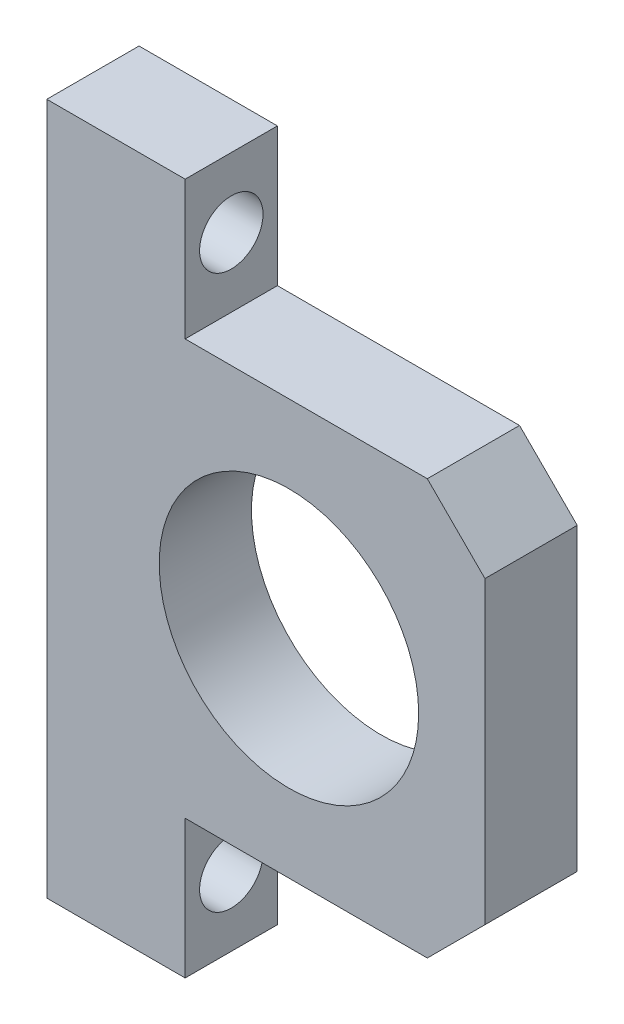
ISO-10303-21;
HEADER;
FILE_DESCRIPTION(('STEP AP214'),'2;1');
FILE_NAME('part.step','',(''),(''),'','','');
FILE_SCHEMA(('AUTOMOTIVE_DESIGN { 1 0 10303 214 1 1 1 1 }'));
ENDSEC;
DATA;
#1=APPLICATION_CONTEXT('core data for automotive mechanical design processes');
#2=APPLICATION_PROTOCOL_DEFINITION('international standard','automotive_design',2000,#1);
#3=PRODUCT_CONTEXT('',#1,'mechanical');
#4=PRODUCT('Part','Part','',(#3));
#5=PRODUCT_RELATED_PRODUCT_CATEGORY('part','',(#4));
#6=PRODUCT_DEFINITION_FORMATION('','',#4);
#7=PRODUCT_DEFINITION_CONTEXT('part definition',#1,'design');
#8=PRODUCT_DEFINITION('design','',#6,#7);
#9=PRODUCT_DEFINITION_SHAPE('','',#8);
#10=(LENGTH_UNIT() NAMED_UNIT(*) SI_UNIT(.MILLI.,.METRE.));
#11=(NAMED_UNIT(*) PLANE_ANGLE_UNIT() SI_UNIT($,.RADIAN.));
#12=(NAMED_UNIT(*) SI_UNIT($,.STERADIAN.) SOLID_ANGLE_UNIT());
#13=UNCERTAINTY_MEASURE_WITH_UNIT(LENGTH_MEASURE(1.E-05),#10,'distance_accuracy_value','');
#14=(GEOMETRIC_REPRESENTATION_CONTEXT(3) GLOBAL_UNCERTAINTY_ASSIGNED_CONTEXT((#13)) GLOBAL_UNIT_ASSIGNED_CONTEXT((#10,
#11,#12)) REPRESENTATION_CONTEXT('',''));
#15=CARTESIAN_POINT('',(0.,0.,0.));
#16=DIRECTION('',(0.,0.,1.));
#17=DIRECTION('',(1.,0.,0.));
#18=AXIS2_PLACEMENT_3D('',#15,#16,#17);
#19=CARTESIAN_POINT('',(171.801480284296,117.437114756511,8.));
#20=DIRECTION('',(1.,0.,0.));
#21=DIRECTION('',(0.,0.,-1.));
#22=AXIS2_PLACEMENT_3D('',#19,#20,#21);
#23=PLANE('',#22);
#24=CARTESIAN_POINT('',(171.801480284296,111.437114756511,4.));
#25=DIRECTION('',(1.,0.,0.));
#26=DIRECTION('',(0.,0.,-1.));
#27=AXIS2_PLACEMENT_3D('',#24,#25,#26);
#28=CIRCLE('',#27,2.75);
#29=CARTESIAN_POINT('',(171.801480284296,111.437114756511,1.25));
#30=VERTEX_POINT('',#29);
#31=EDGE_CURVE('E253',#30,#30,#28,.T.);
#32=ORIENTED_EDGE('',*,*,#31,.T.);
#33=EDGE_LOOP('',(#32));
#34=FACE_BOUND('',#33,.T.);
#35=CARTESIAN_POINT('',(171.801480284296,63.4371147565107,4.));
#36=DIRECTION('',(1.,0.,0.));
#37=DIRECTION('',(0.,0.,-1.));
#38=AXIS2_PLACEMENT_3D('',#35,#36,#37);
#39=CIRCLE('',#38,2.75);
#40=CARTESIAN_POINT('',(171.801480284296,63.4371147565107,1.25));
#41=VERTEX_POINT('',#40);
#42=EDGE_CURVE('E263',#41,#41,#39,.T.);
#43=ORIENTED_EDGE('',*,*,#42,.T.);
#44=EDGE_LOOP('',(#43));
#45=FACE_BOUND('',#44,.T.);
#46=DIRECTION('',(0.,-1.,0.));
#47=VECTOR('',#46,1.);
#48=CARTESIAN_POINT('',(171.801480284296,117.437114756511,0.));
#49=LINE('',#48,#47);
#50=CARTESIAN_POINT('',(171.801480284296,117.437114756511,0.));
#51=VERTEX_POINT('',#50);
#52=CARTESIAN_POINT('',(171.801480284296,57.4371147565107,0.));
#53=VERTEX_POINT('',#52);
#54=EDGE_CURVE('E118',#51,#53,#49,.T.);
#55=ORIENTED_EDGE('',*,*,#54,.T.);
#56=DIRECTION('',(0.,0.,-1.));
#57=VECTOR('',#56,1.);
#58=CARTESIAN_POINT('',(171.801480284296,57.4371147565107,8.));
#59=LINE('',#58,#57);
#60=CARTESIAN_POINT('',(171.801480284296,57.4371147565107,8.));
#61=VERTEX_POINT('',#60);
#62=EDGE_CURVE('E100',#61,#53,#59,.T.);
#63=ORIENTED_EDGE('',*,*,#62,.F.);
#64=DIRECTION('',(0.,-1.,0.));
#65=VECTOR('',#64,1.);
#66=CARTESIAN_POINT('',(171.801480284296,117.437114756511,8.));
#67=LINE('',#66,#65);
#68=CARTESIAN_POINT('',(171.801480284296,117.437114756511,8.));
#69=VERTEX_POINT('',#68);
#70=EDGE_CURVE('E106',#69,#61,#67,.T.);
#71=ORIENTED_EDGE('',*,*,#70,.F.);
#72=DIRECTION('',(0.,0.,-1.));
#73=VECTOR('',#72,1.);
#74=CARTESIAN_POINT('',(171.801480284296,117.437114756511,8.));
#75=LINE('',#74,#73);
#76=EDGE_CURVE('E169',#69,#51,#75,.T.);
#77=ORIENTED_EDGE('',*,*,#76,.T.);
#78=EDGE_LOOP('',(#55,#63,#71,#77));
#79=FACE_BOUND('',#78,.T.);
#80=ADVANCED_FACE('F16',(#34,#45,#79),#23,.F.);
#81=CARTESIAN_POINT('',(171.801480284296,57.4371147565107,8.));
#82=DIRECTION('',(0.,1.,0.));
#83=DIRECTION('',(0.,0.,1.));
#84=AXIS2_PLACEMENT_3D('',#81,#82,#83);
#85=PLANE('',#84);
#86=DIRECTION('',(1.,0.,0.));
#87=VECTOR('',#86,1.);
#88=CARTESIAN_POINT('',(171.801480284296,57.4371147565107,0.));
#89=LINE('',#88,#87);
#90=CARTESIAN_POINT('',(183.801480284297,57.4371147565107,0.));
#91=VERTEX_POINT('',#90);
#92=EDGE_CURVE('E161',#53,#91,#89,.T.);
#93=ORIENTED_EDGE('',*,*,#92,.T.);
#94=DIRECTION('',(0.,0.,-1.));
#95=VECTOR('',#94,1.);
#96=CARTESIAN_POINT('',(183.801480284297,57.4371147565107,8.));
#97=LINE('',#96,#95);
#98=CARTESIAN_POINT('',(183.801480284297,57.4371147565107,8.));
#99=VERTEX_POINT('',#98);
#100=EDGE_CURVE('E103',#99,#91,#97,.T.);
#101=ORIENTED_EDGE('',*,*,#100,.F.);
#102=DIRECTION('',(1.,0.,0.));
#103=VECTOR('',#102,1.);
#104=CARTESIAN_POINT('',(171.801480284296,57.4371147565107,8.));
#105=LINE('',#104,#103);
#106=EDGE_CURVE('E96',#61,#99,#105,.T.);
#107=ORIENTED_EDGE('',*,*,#106,.F.);
#108=ORIENTED_EDGE('',*,*,#62,.T.);
#109=EDGE_LOOP('',(#93,#101,#107,#108));
#110=FACE_BOUND('',#109,.T.);
#111=ADVANCED_FACE('F98',(#110),#85,.F.);
#112=CARTESIAN_POINT('',(183.801480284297,69.4371147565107,8.));
#113=DIRECTION('',(-1.,0.,0.));
#114=DIRECTION('',(0.,0.,1.));
#115=AXIS2_PLACEMENT_3D('',#112,#113,#114);
#116=PLANE('',#115);
#117=CARTESIAN_POINT('',(183.801480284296,63.4371147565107,4.));
#118=DIRECTION('',(1.,0.,0.));
#119=DIRECTION('',(0.,0.,-1.));
#120=AXIS2_PLACEMENT_3D('',#117,#118,#119);
#121=CIRCLE('',#120,2.75);
#122=CARTESIAN_POINT('',(183.801480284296,63.4371147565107,1.25));
#123=VERTEX_POINT('',#122);
#124=EDGE_CURVE('E258',#123,#123,#121,.T.);
#125=ORIENTED_EDGE('',*,*,#124,.F.);
#126=EDGE_LOOP('',(#125));
#127=FACE_BOUND('',#126,.T.);
#128=DIRECTION('',(0.,1.,0.));
#129=VECTOR('',#128,1.);
#130=CARTESIAN_POINT('',(183.801480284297,69.4371147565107,0.));
#131=LINE('',#130,#129);
#132=CARTESIAN_POINT('',(183.801480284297,69.4371147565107,0.));
#133=VERTEX_POINT('',#132);
#134=EDGE_CURVE('E157',#91,#133,#131,.T.);
#135=ORIENTED_EDGE('',*,*,#134,.T.);
#136=DIRECTION('',(0.,0.,-1.));
#137=VECTOR('',#136,1.);
#138=CARTESIAN_POINT('',(183.801480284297,69.4371147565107,8.));
#139=LINE('',#138,#137);
#140=CARTESIAN_POINT('',(183.801480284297,69.4371147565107,8.));
#141=VERTEX_POINT('',#140);
#142=EDGE_CURVE('E123',#141,#133,#139,.T.);
#143=ORIENTED_EDGE('',*,*,#142,.F.);
#144=DIRECTION('',(0.,1.,0.));
#145=VECTOR('',#144,1.);
#146=CARTESIAN_POINT('',(183.801480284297,69.4371147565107,8.));
#147=LINE('',#146,#145);
#148=EDGE_CURVE('E105',#99,#141,#147,.T.);
#149=ORIENTED_EDGE('',*,*,#148,.F.);
#150=ORIENTED_EDGE('',*,*,#100,.T.);
#151=EDGE_LOOP('',(#135,#143,#149,#150));
#152=FACE_BOUND('',#151,.T.);
#153=ADVANCED_FACE('F194',(#127,#152),#116,.F.);
#154=CARTESIAN_POINT('',(183.801480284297,69.4371147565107,8.));
#155=DIRECTION('',(0.,1.,0.));
#156=DIRECTION('',(0.,0.,1.));
#157=AXIS2_PLACEMENT_3D('',#154,#155,#156);
#158=PLANE('',#157);
#159=DIRECTION('',(1.,0.,0.));
#160=VECTOR('',#159,1.);
#161=CARTESIAN_POINT('',(183.801480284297,69.4371147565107,0.));
#162=LINE('',#161,#160);
#163=CARTESIAN_POINT('',(204.801480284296,69.4371147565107,0.));
#164=VERTEX_POINT('',#163);
#165=EDGE_CURVE('E152',#133,#164,#162,.T.);
#166=ORIENTED_EDGE('',*,*,#165,.T.);
#167=DIRECTION('',(0.,0.,1.));
#168=VECTOR('',#167,1.);
#169=CARTESIAN_POINT('',(204.801480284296,69.4371147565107,8.));
#170=LINE('',#169,#168);
#171=CARTESIAN_POINT('',(204.801480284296,69.4371147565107,8.));
#172=VERTEX_POINT('',#171);
#173=EDGE_CURVE('E39',#164,#172,#170,.T.);
#174=ORIENTED_EDGE('',*,*,#173,.T.);
#175=DIRECTION('',(1.,0.,0.));
#176=VECTOR('',#175,1.);
#177=CARTESIAN_POINT('',(183.801480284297,69.4371147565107,8.));
#178=LINE('',#177,#176);
#179=EDGE_CURVE('E137',#141,#172,#178,.T.);
#180=ORIENTED_EDGE('',*,*,#179,.F.);
#181=ORIENTED_EDGE('',*,*,#142,.T.);
#182=EDGE_LOOP('',(#166,#174,#180,#181));
#183=FACE_BOUND('',#182,.T.);
#184=ADVANCED_FACE('F155',(#183),#158,.F.);
#185=CARTESIAN_POINT('',(209.801480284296,105.437114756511,8.));
#186=DIRECTION('',(-1.,0.,0.));
#187=DIRECTION('',(0.,0.,1.));
#188=AXIS2_PLACEMENT_3D('',#185,#186,#187);
#189=PLANE('',#188);
#190=DIRECTION('',(0.,1.,0.));
#191=VECTOR('',#190,1.);
#192=CARTESIAN_POINT('',(209.801480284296,105.437114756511,8.));
#193=LINE('',#192,#191);
#194=CARTESIAN_POINT('',(209.801480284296,74.4371147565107,8.));
#195=VERTEX_POINT('',#194);
#196=CARTESIAN_POINT('',(209.801480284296,100.437114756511,8.));
#197=VERTEX_POINT('',#196);
#198=EDGE_CURVE('E136',#195,#197,#193,.T.);
#199=ORIENTED_EDGE('',*,*,#198,.F.);
#200=DIRECTION('',(0.,0.,-1.));
#201=VECTOR('',#200,1.);
#202=CARTESIAN_POINT('',(209.801480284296,74.4371147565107,8.));
#203=LINE('',#202,#201);
#204=CARTESIAN_POINT('',(209.801480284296,74.4371147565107,0.));
#205=VERTEX_POINT('',#204);
#206=EDGE_CURVE('E121',#195,#205,#203,.T.);
#207=ORIENTED_EDGE('',*,*,#206,.T.);
#208=DIRECTION('',(0.,1.,0.));
#209=VECTOR('',#208,1.);
#210=CARTESIAN_POINT('',(209.801480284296,105.437114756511,0.));
#211=LINE('',#210,#209);
#212=CARTESIAN_POINT('',(209.801480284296,100.437114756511,0.));
#213=VERTEX_POINT('',#212);
#214=EDGE_CURVE('E153',#205,#213,#211,.T.);
#215=ORIENTED_EDGE('',*,*,#214,.T.);
#216=DIRECTION('',(0.,0.,1.));
#217=VECTOR('',#216,1.);
#218=CARTESIAN_POINT('',(209.801480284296,100.437114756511,8.));
#219=LINE('',#218,#217);
#220=EDGE_CURVE('E119',#213,#197,#219,.T.);
#221=ORIENTED_EDGE('',*,*,#220,.T.);
#222=EDGE_LOOP('',(#199,#207,#215,#221));
#223=FACE_BOUND('',#222,.T.);
#224=ADVANCED_FACE('F141',(#223),#189,.F.);
#225=CARTESIAN_POINT('',(183.801480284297,105.437114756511,8.));
#226=DIRECTION('',(0.,-1.,0.));
#227=DIRECTION('',(0.,0.,-1.));
#228=AXIS2_PLACEMENT_3D('',#225,#226,#227);
#229=PLANE('',#228);
#230=DIRECTION('',(-1.,0.,0.));
#231=VECTOR('',#230,1.);
#232=CARTESIAN_POINT('',(183.801480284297,105.437114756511,8.));
#233=LINE('',#232,#231);
#234=CARTESIAN_POINT('',(204.801480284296,105.437114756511,8.));
#235=VERTEX_POINT('',#234);
#236=CARTESIAN_POINT('',(183.801480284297,105.437114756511,8.));
#237=VERTEX_POINT('',#236);
#238=EDGE_CURVE('E145',#235,#237,#233,.T.);
#239=ORIENTED_EDGE('',*,*,#238,.F.);
#240=DIRECTION('',(0.,0.,-1.));
#241=VECTOR('',#240,1.);
#242=CARTESIAN_POINT('',(204.801480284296,105.437114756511,8.));
#243=LINE('',#242,#241);
#244=CARTESIAN_POINT('',(204.801480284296,105.437114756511,0.));
#245=VERTEX_POINT('',#244);
#246=EDGE_CURVE('E11',#235,#245,#243,.T.);
#247=ORIENTED_EDGE('',*,*,#246,.T.);
#248=DIRECTION('',(-1.,0.,0.));
#249=VECTOR('',#248,1.);
#250=CARTESIAN_POINT('',(183.801480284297,105.437114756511,0.));
#251=LINE('',#250,#249);
#252=CARTESIAN_POINT('',(183.801480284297,105.437114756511,0.));
#253=VERTEX_POINT('',#252);
#254=EDGE_CURVE('E159',#245,#253,#251,.T.);
#255=ORIENTED_EDGE('',*,*,#254,.T.);
#256=DIRECTION('',(0.,0.,-1.));
#257=VECTOR('',#256,1.);
#258=CARTESIAN_POINT('',(183.801480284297,105.437114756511,8.));
#259=LINE('',#258,#257);
#260=EDGE_CURVE('E174',#237,#253,#259,.T.);
#261=ORIENTED_EDGE('',*,*,#260,.F.);
#262=EDGE_LOOP('',(#239,#247,#255,#261));
#263=FACE_BOUND('',#262,.T.);
#264=ADVANCED_FACE('F198',(#263),#229,.F.);
#265=CARTESIAN_POINT('',(183.801480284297,117.437114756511,8.));
#266=DIRECTION('',(-1.,0.,0.));
#267=DIRECTION('',(0.,-1.,0.));
#268=AXIS2_PLACEMENT_3D('',#265,#266,#267);
#269=PLANE('',#268);
#270=CARTESIAN_POINT('',(183.801480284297,111.437114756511,4.));
#271=DIRECTION('',(1.,0.,0.));
#272=DIRECTION('',(0.,0.,-1.));
#273=AXIS2_PLACEMENT_3D('',#270,#271,#272);
#274=CIRCLE('',#273,2.75);
#275=CARTESIAN_POINT('',(183.801480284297,111.437114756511,1.25));
#276=VERTEX_POINT('',#275);
#277=EDGE_CURVE('E256',#276,#276,#274,.T.);
#278=ORIENTED_EDGE('',*,*,#277,.F.);
#279=EDGE_LOOP('',(#278));
#280=FACE_BOUND('',#279,.T.);
#281=DIRECTION('',(0.,1.,0.));
#282=VECTOR('',#281,1.);
#283=CARTESIAN_POINT('',(183.801480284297,117.437114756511,0.));
#284=LINE('',#283,#282);
#285=CARTESIAN_POINT('',(183.801480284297,117.437114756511,0.));
#286=VERTEX_POINT('',#285);
#287=EDGE_CURVE('E166',#253,#286,#284,.T.);
#288=ORIENTED_EDGE('',*,*,#287,.T.);
#289=DIRECTION('',(0.,0.,-1.));
#290=VECTOR('',#289,1.);
#291=CARTESIAN_POINT('',(183.801480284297,117.437114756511,8.));
#292=LINE('',#291,#290);
#293=CARTESIAN_POINT('',(183.801480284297,117.437114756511,8.));
#294=VERTEX_POINT('',#293);
#295=EDGE_CURVE('E171',#294,#286,#292,.T.);
#296=ORIENTED_EDGE('',*,*,#295,.F.);
#297=DIRECTION('',(0.,1.,0.));
#298=VECTOR('',#297,1.);
#299=CARTESIAN_POINT('',(183.801480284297,117.437114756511,8.));
#300=LINE('',#299,#298);
#301=EDGE_CURVE('E182',#237,#294,#300,.T.);
#302=ORIENTED_EDGE('',*,*,#301,.F.);
#303=ORIENTED_EDGE('',*,*,#260,.T.);
#304=EDGE_LOOP('',(#288,#296,#302,#303));
#305=FACE_BOUND('',#304,.T.);
#306=ADVANCED_FACE('F180',(#280,#305),#269,.F.);
#307=CARTESIAN_POINT('',(171.801480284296,117.437114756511,8.));
#308=DIRECTION('',(0.,-1.,0.));
#309=DIRECTION('',(0.,0.,-1.));
#310=AXIS2_PLACEMENT_3D('',#307,#308,#309);
#311=PLANE('',#310);
#312=DIRECTION('',(-1.,0.,0.));
#313=VECTOR('',#312,1.);
#314=CARTESIAN_POINT('',(171.801480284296,117.437114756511,0.));
#315=LINE('',#314,#313);
#316=EDGE_CURVE('E115',#286,#51,#315,.T.);
#317=ORIENTED_EDGE('',*,*,#316,.T.);
#318=ORIENTED_EDGE('',*,*,#76,.F.);
#319=DIRECTION('',(-1.,0.,0.));
#320=VECTOR('',#319,1.);
#321=CARTESIAN_POINT('',(171.801480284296,117.437114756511,8.));
#322=LINE('',#321,#320);
#323=EDGE_CURVE('E111',#294,#69,#322,.T.);
#324=ORIENTED_EDGE('',*,*,#323,.F.);
#325=ORIENTED_EDGE('',*,*,#295,.T.);
#326=EDGE_LOOP('',(#317,#318,#324,#325));
#327=FACE_BOUND('',#326,.T.);
#328=ADVANCED_FACE('F187',(#327),#311,.F.);
#329=CARTESIAN_POINT('',(0.,0.,8.));
#330=DIRECTION('',(0.,0.,1.));
#331=DIRECTION('',(1.,0.,0.));
#332=AXIS2_PLACEMENT_3D('',#329,#330,#331);
#333=PLANE('',#332);
#334=CARTESIAN_POINT('',(192.801480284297,87.4371147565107,8.));
#335=DIRECTION('',(0.,0.,1.));
#336=DIRECTION('',(1.,0.,0.));
#337=AXIS2_PLACEMENT_3D('',#334,#335,#336);
#338=CIRCLE('',#337,11.25);
#339=CARTESIAN_POINT('',(204.051480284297,87.4371147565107,8.));
#340=VERTEX_POINT('',#339);
#341=EDGE_CURVE('E266',#340,#340,#338,.T.);
#342=ORIENTED_EDGE('',*,*,#341,.F.);
#343=EDGE_LOOP('',(#342));
#344=FACE_BOUND('',#343,.T.);
#345=ORIENTED_EDGE('',*,*,#179,.T.);
#346=DIRECTION('',(-0.707106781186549,-0.707106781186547,0.));
#347=VECTOR('',#346,1.);
#348=CARTESIAN_POINT('',(67.6821827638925,-67.6821827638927,8.));
#349=LINE('',#348,#347);
#350=EDGE_CURVE('E24',#172,#195,#349,.F.);
#351=ORIENTED_EDGE('',*,*,#350,.T.);
#352=ORIENTED_EDGE('',*,*,#198,.T.);
#353=DIRECTION('',(0.707106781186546,-0.70710678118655,0.));
#354=VECTOR('',#353,1.);
#355=CARTESIAN_POINT('',(155.119297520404,155.119297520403,8.));
#356=LINE('',#355,#354);
#357=EDGE_CURVE('E31',#197,#235,#356,.F.);
#358=ORIENTED_EDGE('',*,*,#357,.T.);
#359=ORIENTED_EDGE('',*,*,#238,.T.);
#360=ORIENTED_EDGE('',*,*,#301,.T.);
#361=ORIENTED_EDGE('',*,*,#323,.T.);
#362=ORIENTED_EDGE('',*,*,#70,.T.);
#363=ORIENTED_EDGE('',*,*,#106,.T.);
#364=ORIENTED_EDGE('',*,*,#148,.T.);
#365=EDGE_LOOP('',(#345,#351,#352,#358,#359,#360,#361,#362,#363,#364));
#366=FACE_BOUND('',#365,.T.);
#367=ADVANCED_FACE('F109',(#344,#366),#333,.T.);
#368=CARTESIAN_POINT('',(0.,0.,0.));
#369=DIRECTION('',(0.,0.,1.));
#370=DIRECTION('',(1.,0.,0.));
#371=AXIS2_PLACEMENT_3D('',#368,#369,#370);
#372=PLANE('',#371);
#373=CARTESIAN_POINT('',(192.801480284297,87.4371147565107,0.));
#374=DIRECTION('',(0.,0.,1.));
#375=DIRECTION('',(1.,0.,0.));
#376=AXIS2_PLACEMENT_3D('',#373,#374,#375);
#377=CIRCLE('',#376,11.25);
#378=CARTESIAN_POINT('',(204.051480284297,87.4371147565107,0.));
#379=VERTEX_POINT('',#378);
#380=EDGE_CURVE('E192',#379,#379,#377,.T.);
#381=ORIENTED_EDGE('',*,*,#380,.T.);
#382=EDGE_LOOP('',(#381));
#383=FACE_BOUND('',#382,.T.);
#384=ORIENTED_EDGE('',*,*,#214,.F.);
#385=DIRECTION('',(0.707106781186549,0.707106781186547,0.));
#386=VECTOR('',#385,1.);
#387=CARTESIAN_POINT('',(209.801480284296,74.4371147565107,0.));
#388=LINE('',#387,#386);
#389=EDGE_CURVE('E131',#205,#164,#388,.F.);
#390=ORIENTED_EDGE('',*,*,#389,.T.);
#391=ORIENTED_EDGE('',*,*,#165,.F.);
#392=ORIENTED_EDGE('',*,*,#134,.F.);
#393=ORIENTED_EDGE('',*,*,#92,.F.);
#394=ORIENTED_EDGE('',*,*,#54,.F.);
#395=ORIENTED_EDGE('',*,*,#316,.F.);
#396=ORIENTED_EDGE('',*,*,#287,.F.);
#397=ORIENTED_EDGE('',*,*,#254,.F.);
#398=DIRECTION('',(-0.707106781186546,0.70710678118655,0.));
#399=VECTOR('',#398,1.);
#400=CARTESIAN_POINT('',(204.801480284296,105.437114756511,0.));
#401=LINE('',#400,#399);
#402=EDGE_CURVE('E129',#245,#213,#401,.F.);
#403=ORIENTED_EDGE('',*,*,#402,.T.);
#404=EDGE_LOOP('',(#384,#390,#391,#392,#393,#394,#395,#396,#397,#403));
#405=FACE_BOUND('',#404,.T.);
#406=ADVANCED_FACE('F150',(#383,#405),#372,.F.);
#407=CARTESIAN_POINT('',(192.801480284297,87.4371147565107,0.));
#408=DIRECTION('',(0.,0.,1.));
#409=DIRECTION('',(1.,0.,0.));
#410=AXIS2_PLACEMENT_3D('',#407,#408,#409);
#411=CYLINDRICAL_SURFACE('',#410,11.25);
#412=ORIENTED_EDGE('',*,*,#380,.F.);
#413=EDGE_LOOP('',(#412));
#414=FACE_BOUND('',#413,.T.);
#415=ORIENTED_EDGE('',*,*,#341,.T.);
#416=EDGE_LOOP('',(#415));
#417=FACE_BOUND('',#416,.T.);
#418=ADVANCED_FACE('F234',(#414,#417),#411,.F.);
#419=CARTESIAN_POINT('',(183.801480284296,63.4371147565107,4.));
#420=DIRECTION('',(1.,0.,0.));
#421=DIRECTION('',(0.,0.,-1.));
#422=AXIS2_PLACEMENT_3D('',#419,#420,#421);
#423=CYLINDRICAL_SURFACE('',#422,2.75);
#424=ORIENTED_EDGE('',*,*,#42,.F.);
#425=EDGE_LOOP('',(#424));
#426=FACE_BOUND('',#425,.T.);
#427=ORIENTED_EDGE('',*,*,#124,.T.);
#428=EDGE_LOOP('',(#427));
#429=FACE_BOUND('',#428,.T.);
#430=ADVANCED_FACE('F241',(#426,#429),#423,.F.);
#431=CARTESIAN_POINT('',(183.801480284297,111.437114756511,4.));
#432=DIRECTION('',(1.,0.,0.));
#433=DIRECTION('',(0.,0.,-1.));
#434=AXIS2_PLACEMENT_3D('',#431,#432,#433);
#435=CYLINDRICAL_SURFACE('',#434,2.75);
#436=ORIENTED_EDGE('',*,*,#31,.F.);
#437=EDGE_LOOP('',(#436));
#438=FACE_BOUND('',#437,.T.);
#439=ORIENTED_EDGE('',*,*,#277,.T.);
#440=EDGE_LOOP('',(#439));
#441=FACE_BOUND('',#440,.T.);
#442=ADVANCED_FACE('F206',(#438,#441),#435,.F.);
#443=CARTESIAN_POINT('',(209.801480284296,74.4371147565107,8.));
#444=DIRECTION('',(-0.707106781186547,0.707106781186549,0.));
#445=DIRECTION('',(0.,0.,-1.));
#446=AXIS2_PLACEMENT_3D('',#443,#444,#445);
#447=PLANE('',#446);
#448=ORIENTED_EDGE('',*,*,#350,.F.);
#449=ORIENTED_EDGE('',*,*,#173,.F.);
#450=ORIENTED_EDGE('',*,*,#389,.F.);
#451=ORIENTED_EDGE('',*,*,#206,.F.);
#452=EDGE_LOOP('',(#448,#449,#450,#451));
#453=FACE_BOUND('',#452,.T.);
#454=ADVANCED_FACE('F147',(#453),#447,.F.);
#455=CARTESIAN_POINT('',(204.801480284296,105.437114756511,8.));
#456=DIRECTION('',(-0.707106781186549,-0.707106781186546,0.));
#457=DIRECTION('',(0.,0.,-1.));
#458=AXIS2_PLACEMENT_3D('',#455,#456,#457);
#459=PLANE('',#458);
#460=ORIENTED_EDGE('',*,*,#357,.F.);
#461=ORIENTED_EDGE('',*,*,#220,.F.);
#462=ORIENTED_EDGE('',*,*,#402,.F.);
#463=ORIENTED_EDGE('',*,*,#246,.F.);
#464=EDGE_LOOP('',(#460,#461,#462,#463));
#465=FACE_BOUND('',#464,.T.);
#466=ADVANCED_FACE('F18',(#465),#459,.F.);
#467=CLOSED_SHELL('',(#80,#111,#153,#184,#224,#264,#306,#328,#367,#406,#418,#430,#442,#454,#466));
#468=MANIFOLD_SOLID_BREP('B1',#467);
#469=ADVANCED_BREP_SHAPE_REPRESENTATION('',(#18,#468),#14);
#470=SHAPE_DEFINITION_REPRESENTATION(#9,#469);
ENDSEC;
END-ISO-10303-21;
